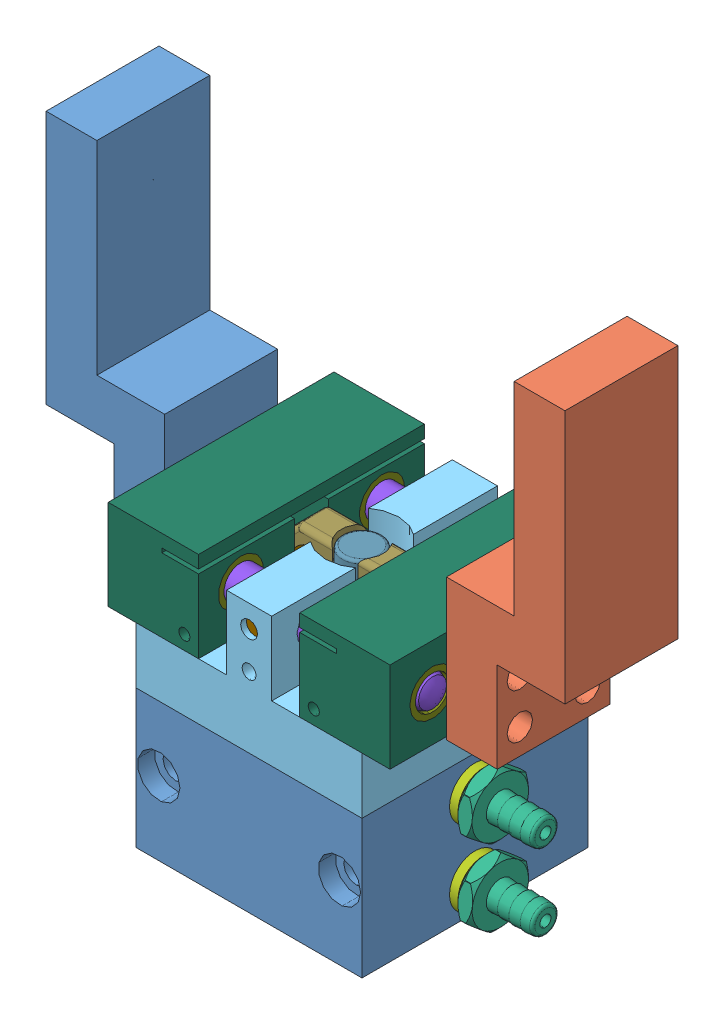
SolidWorks assembly pincestat.SLDASM, configuration Défaut (file format 3100). Lengths in mm.
Overall size (92.51 114.28 60.95).
42 component instances, 21 part files, 34 mates.
Components (placement in the parent):
- corps-2: corps.SLDASM [Défaut] at (76.6059 58.7724 68.0172) x (0.758814 -0.644142 -0.096343) z (0.651307 0.750467 0.112246) size (75.23 46.59 67.93)
  - 3-1: 3.sldprt [Défaut] at (-15.749 58.5752 -103.3778) x (0.758814 0 0.651307) z (-0.096343 -0.988999 0.112246) size (40 24.5 40)
  - 6-1: 6.SLDPRT [Défaut] at (-20.2135 42.8631 -67.4689) x (0.762446 0.045543 0.645447) z (0.644142 -0.147922 -0.750467) size (28 28 10)
  - 16-1: 16.SLDPRT [Défaut] at (-17.3148 42.1974 -70.846) x (0.695484 0.521675 0.494123) z (0.318408 -0.840223 0.43891) size (20.5 2.5 20.5)
  - 17-1: 17.SLDPRT [Défaut] at (-14.7383 41.6057 -73.8479) x (0.695484 0.521675 0.494123) z (0.318408 -0.840223 0.43891) size (25 1.5 25)
  - 7-1: 7.sldprt [Défaut] at (-1.1779 62.1993 -58.9391) x (-0.758814 0 -0.651307) z (-0.644142 0.147922 0.750467) size (40 40 23)
  - 19-1: 19.SLDPRT [Défaut] at (4.1748 41.5318 -58.2661) x (-0.466408 0.697987 0.543395) z (-0.758814 0 -0.651307) size (10 11.5 16)
  - 18-3: 18.SLDPRT [Défaut] at (0.7601 41.5318 -61.197) x (0.651307 0 -0.758814) z (0.758814 0 0.651307) size (9 9 1.5)
  - 18-4: 18.SLDPRT [Défaut] at (9.456 39.5348 -71.3283) x (0.651307 0 -0.758814) z (0.758814 0 0.651307) size (9 9 1.5)
  - 19-2: 19.SLDPRT [Défaut] at (12.8707 39.5348 -68.3974) x (-0.634746 -0.224072 0.73952) z (-0.758814 0 -0.651307) size (10 11.5 16)
  - 1-1: 1.sldprt [Défaut] at (-12.1095 32.7194 -38.5262) x (0.644142 -0.147922 -0.750467) z (-0.758814 0 -0.651307) size (6 6 50.75)
  - 1-2: 1.sldprt [Défaut] at (-9.7009 57.4444 -41.3323) x (-0.644142 0.147922 0.750467) z (-0.758814 0 -0.651307) size (6 6 50.75)
  - 22-1: 22.SLDPRT [Défaut] at (-32.3502 26.4388 -53.3288) x (-0.852619 0.023815 -0.521989) z (0.096343 0.988999 -0.112246) size (4 4 4)
  - 22-2: 22.SLDPRT [Défaut] at (-28.6892 64.0208 -57.5941) x (0.991655 -0.085667 0.096343) z (-0.096343 -0.988999 0.112246) size (4 4 4)
- piston-1: piston.SLDASM [Défaut] at (17.3246 33.9581 20) x (1 0 0) z (0 -1 0) size (32 31.19 36.5)
  - 15-1: 15.sldprt [Défaut] at origin size (12.5 12.5 23)
  - 4-1: 4.sldprt [Défaut] at (0 0 23) x (0.290765 -0.956794 0) z (0 0 -1) size (25 25 6.5)
  - 8-1: 8.sldprt [Défaut] at (0 -3 1) x (1 0 0) z (0 1 0) size (32 14 6)
  - 5-1: 5.SLDPRT [Défaut] at (0 0 21) x (0.992028 -0.126014 0) z (0.126014 0.992028 0) size (25 3 25)
  - 13-1: 13.SLDPRT [Défaut] at (0 0 -12.5) size (7 7 19)
- mors-1: mors.SLDASM [Défaut] at (163.3153 23.0019 0.3809) x (-0.898967 -0.065578 0.43308) z (-0.43308 -0.014956 -0.901231) size (32.76 17.61 43.22)
  - 9-1: 9.SLDPRT [Défaut] at (125.2085 20.0017 16.5389) x (0.898967 0.065578 0.43308) z (-0.43308 -0.014956 0.901231) size (16 16 40)
  - 2-1: 2.SLDPRT [Défaut] at (110.6087 27.4975 45.7093) x (0.358137 -0.679297 -0.640542) z (0.898967 0.065578 0.43308) size (8 8 16)
  - 2-2: 2.SLDPRT [Défaut] at (121.4357 27.8714 23.1785) x (0.437561 -0.179571 -0.881076) z (0.898967 0.065578 0.43308) size (8 8 16)
  - 10-1: 10.SLDPRT [Défaut] at (128.519 23.0822 40.3727) x (0.901349 -0.003407 0.43308) z (-0.43308 -0.014956 0.901231) size (2 2 24)
- mors-2: mors.SLDASM [Défaut] at (-128.666 23.0019 39.6191) x (0.898967 -0.065578 -0.43308) z (0.43308 -0.014956 0.901231) size (32.76 17.61 43.22)
  - 9-1: 9.SLDPRT [Défaut] at (125.2085 20.0017 16.5389) x (0.898967 0.065578 0.43308) z (-0.43308 -0.014956 0.901231) size (16 16 40)
  - 2-1: 2.SLDPRT [Défaut] at (110.6087 27.4975 45.7093) x (0.358137 -0.679297 -0.640542) z (0.898967 0.065578 0.43308) size (8 8 16)
  - 2-2: 2.SLDPRT [Défaut] at (121.4357 27.8714 23.1785) x (0.437561 -0.179571 -0.881076) z (0.898967 0.065578 0.43308) size (8 8 16)
  - 10-1: 10.SLDPRT [Défaut] at (128.519 23.0822 40.3727) x (0.901349 -0.003407 0.43308) z (-0.43308 -0.014956 0.901231) size (2 2 24)
- galet-1: galet.SLDPRT [Défaut] at (28.7827 37 17) size (5 5 6)
- galet-2: galet.SLDPRT [Défaut] at (5.8666 37 17) size (5 5 6)
- Mâchoire gauche-1: Mâchoire gauche.SLDPRT [Défaut] at (-7.6334 34 20) x (0 1 0) z (0 0 -1) size (61 21 20)
- Mâchoire droite-1: Mâchoire droite.SLDPRT [Défaut] at (42.2827 34 20) x (0 1 0) z (0 0 1) size (61 21 20)
- vis M4-12-1: vis M4-12.SLDPRT [Default] at (-20.6334 46.5 14) x (1 0 0) z (0 0.999488 0.03199) size (16 7 7) (hidden)
- vis M4-12-2: vis M4-12.SLDPRT [Default] at (-20.6334 38.5 26) size (16 7 7) (hidden)
- vis M4-12-3: vis M4-12.SLDPRT [Default] at (-20.6334 46.5 26) size (16 7 7) (hidden)
- vis M4-12-4: vis M4-12.SLDPRT [Default] at (-20.6334 38.5 14) size (16 7 7) (hidden)
- vis M4-12-5: vis M4-12.SLDPRT [Default] at (55.2827 46.5 26) x (-1 0 0) z (0 0.325543 -0.945527) size (16 7 7) (hidden)
- vis M4-12-6: vis M4-12.SLDPRT [Default] at (55.2827 38.5 26) x (-1 0 0) z (0 -0.543966 -0.839107) size (16 7 7) (hidden)
- vis M4-12-7: vis M4-12.SLDPRT [Default] at (55.2827 38.5 14) x (-1 0 0) z (0 -0.67575 -0.73713) size (16 7 7) (hidden)
- vis M4-12-8: vis M4-12.SLDPRT [Default] at (55.2827 46.5 14) x (-1 0 0) z (0 -0.894857 -0.446353) size (16 7 7) (hidden)
Mates (geometry in assembly coordinates):
- Coaxial1: concentric anti-aligned: cylinder of ?; cylinder of piston-1/4-1
- Parallèle1: parallel anti-aligned: plane of ?; plane of ?
- Coaxial2: concentric aligned: cylinder of ?; cylinder of mors-1/2-2
- Coaxial3: concentric aligned: cylinder of ?; cylinder of ?
- Coaxial4: concentric anti-aligned: cylinder of ?; cylinder of ?
- Coaxial5: concentric anti-aligned: cylinder of ?; cylinder of ?
- Coïncidente1: coincident anti-aligned: plane of ?; plane of galet-1
- Coaxial7: concentric anti-aligned: cylinder of ?; cylinder of galet-1
- Tangent1: tangent anti-aligned: plane of ?; cylinder of galet-1
- Coïncidente2: coincident anti-aligned: plane of ?; plane of galet-2
- Coaxial8: concentric aligned: cylinder of ?; cylinder of galet-2
- Tangent2: tangent anti-aligned: plane of ?; cylinder of galet-2
- Coïncidente3: coincident anti-aligned: plane of ?; plane of Mâchoire droite-1 through (42.2827 34 30) normal (-1 0 0)
- Coaxial9: concentric anti-aligned: cylinder of ?; cylinder of Mâchoire droite-1
- Coaxial10: concentric anti-aligned: cylinder of ?; cylinder of Mâchoire droite-1
- Coaxial11: concentric aligned: cylinder of ?; cylinder of vis M4-12-5
- Coaxial12: concentric aligned: cylinder of ?; cylinder of vis M4-12-8
- Coaxial13: concentric aligned: cylinder of ?; cylinder of vis M4-12-6
- Coaxial14: concentric aligned: cylinder of ?; cylinder of vis M4-12-7
- Coïncidente4: coincident anti-aligned: plane of Mâchoire droite-1 through (51.2827 50 30) normal (1 0 0); plane of vis M4-12-5
- Coïncidente5: coincident anti-aligned: plane of Mâchoire droite-1 through (51.2827 50 30) normal (1 0 0); plane of vis M4-12-8
- Coïncidente6: coincident anti-aligned: plane of Mâchoire droite-1 through (51.2827 50 30) normal (1 0 0); plane of vis M4-12-7
- Coïncidente7: coincident anti-aligned: plane of Mâchoire droite-1 through (51.2827 50 30) normal (1 0 0); plane of vis M4-12-6
- Coïncidente9: coincident anti-aligned: plane of ?; plane of Mâchoire gauche-1 through (-7.6334 34 10) normal (1 0 0)
- Coaxial15: concentric anti-aligned: cylinder of ?; cylinder of Mâchoire gauche-1
- Coaxial16: concentric anti-aligned: cylinder of ?; cylinder of Mâchoire gauche-1
- Coaxial17: concentric aligned: cylinder of ?; cylinder of vis M4-12-1
- Coaxial18: concentric aligned: cylinder of ?; cylinder of vis M4-12-4
- Coaxial19: concentric aligned: cylinder of ?; cylinder of vis M4-12-2
- Coaxial20: concentric aligned: cylinder of ?; cylinder of vis M4-12-3
- Coïncidente10: coincident anti-aligned: plane of Mâchoire gauche-1 through (-16.6334 50 10) normal (-1 0 0); plane of vis M4-12-1
- Coïncidente11: coincident anti-aligned: plane of Mâchoire gauche-1 through (-16.6334 50 10) normal (-1 0 0); plane of vis M4-12-3
- Coïncidente12: coincident anti-aligned: plane of Mâchoire gauche-1 through (-16.6334 50 10) normal (-1 0 0); plane of vis M4-12-2
- Coïncidente13: coincident anti-aligned: plane of Mâchoire gauche-1 through (-16.6334 50 10) normal (-1 0 0); plane of vis M4-12-4
